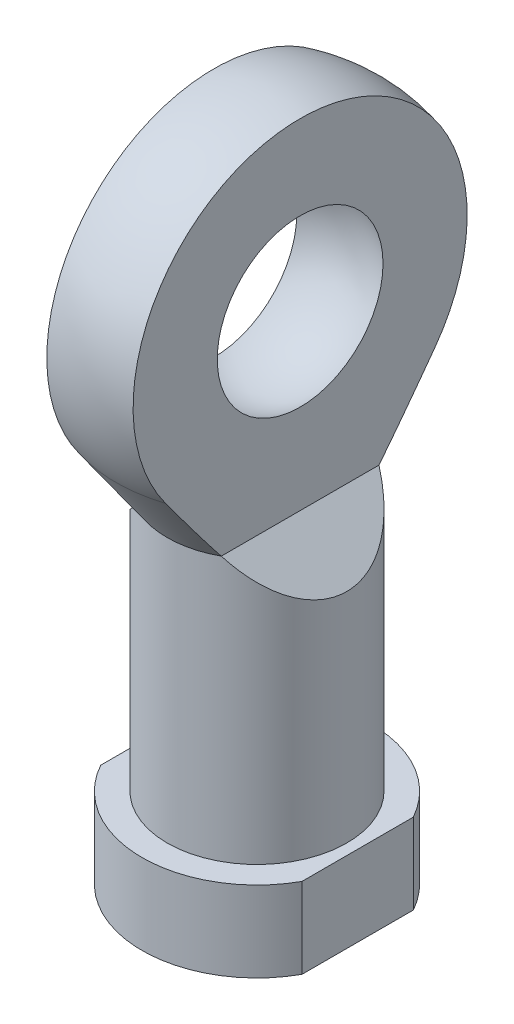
ISO-10303-21;
HEADER;
FILE_DESCRIPTION(('STEP AP214'),'2;1');
FILE_NAME('part.step','',(''),(''),'','','');
FILE_SCHEMA(('AUTOMOTIVE_DESIGN { 1 0 10303 214 1 1 1 1 }'));
ENDSEC;
DATA;
#1=APPLICATION_CONTEXT('core data for automotive mechanical design processes');
#2=APPLICATION_PROTOCOL_DEFINITION('international standard','automotive_design',2000,#1);
#3=PRODUCT_CONTEXT('',#1,'mechanical');
#4=PRODUCT('Part','Part','',(#3));
#5=PRODUCT_RELATED_PRODUCT_CATEGORY('part','',(#4));
#6=PRODUCT_DEFINITION_FORMATION('','',#4);
#7=PRODUCT_DEFINITION_CONTEXT('part definition',#1,'design');
#8=PRODUCT_DEFINITION('design','',#6,#7);
#9=PRODUCT_DEFINITION_SHAPE('','',#8);
#10=(LENGTH_UNIT() NAMED_UNIT(*) SI_UNIT(.MILLI.,.METRE.));
#11=(NAMED_UNIT(*) PLANE_ANGLE_UNIT() SI_UNIT($,.RADIAN.));
#12=(NAMED_UNIT(*) SI_UNIT($,.STERADIAN.) SOLID_ANGLE_UNIT());
#13=UNCERTAINTY_MEASURE_WITH_UNIT(LENGTH_MEASURE(1.E-05),#10,'distance_accuracy_value','');
#14=(GEOMETRIC_REPRESENTATION_CONTEXT(3) GLOBAL_UNCERTAINTY_ASSIGNED_CONTEXT((#13)) GLOBAL_UNIT_ASSIGNED_CONTEXT((#10,
#11,#12)) REPRESENTATION_CONTEXT('',''));
#15=CARTESIAN_POINT('',(0.,0.,0.));
#16=DIRECTION('',(0.,0.,1.));
#17=DIRECTION('',(1.,0.,0.));
#18=AXIS2_PLACEMENT_3D('',#15,#16,#17);
#19=CARTESIAN_POINT('',(0.,-15.9999999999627,0.));
#20=DIRECTION('',(0.,-1.,0.));
#21=DIRECTION('',(0.,0.,-1.));
#22=AXIS2_PLACEMENT_3D('',#19,#20,#21);
#23=CONICAL_SURFACE('',#22,2.99999999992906,1.04719755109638);
#24=CARTESIAN_POINT('',(-1.4210854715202E-10,-14.2679491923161,0.));
#25=VERTEX_POINT('',#24);
#26=VERTEX_LOOP('',#25);
#27=FACE_BOUND('',#26,.T.);
#28=CARTESIAN_POINT('',(0.,-16.,0.));
#29=DIRECTION('',(0.,1.,0.));
#30=DIRECTION('',(-1.,0.,0.));
#31=AXIS2_PLACEMENT_3D('',#28,#29,#30);
#32=CIRCLE('',#31,3.);
#33=CARTESIAN_POINT('',(-3.,-16.,0.));
#34=VERTEX_POINT('',#33);
#35=EDGE_CURVE('E88',#34,#34,#32,.F.);
#36=ORIENTED_EDGE('',*,*,#35,.T.);
#37=EDGE_LOOP('',(#36));
#38=FACE_BOUND('',#37,.T.);
#39=ADVANCED_FACE('F16',(#27,#38),#23,.F.);
#40=CARTESIAN_POINT('',(0.,-26.,0.));
#41=DIRECTION('',(0.,1.,0.));
#42=DIRECTION('',(-1.,0.,0.));
#43=AXIS2_PLACEMENT_3D('',#40,#41,#42);
#44=CYLINDRICAL_SURFACE('',#43,3.);
#45=CARTESIAN_POINT('',(0.,-36.,0.));
#46=DIRECTION('',(0.,1.,0.));
#47=DIRECTION('',(-1.,0.,0.));
#48=AXIS2_PLACEMENT_3D('',#45,#46,#47);
#49=CIRCLE('',#48,3.);
#50=CARTESIAN_POINT('',(-3.,-36.,0.));
#51=VERTEX_POINT('',#50);
#52=EDGE_CURVE('E19',#51,#51,#49,.T.);
#53=ORIENTED_EDGE('',*,*,#52,.F.);
#54=EDGE_LOOP('',(#53));
#55=FACE_BOUND('',#54,.T.);
#56=ORIENTED_EDGE('',*,*,#35,.F.);
#57=EDGE_LOOP('',(#56));
#58=FACE_BOUND('',#57,.T.);
#59=ADVANCED_FACE('F85',(#55,#58),#44,.F.);
#60=CARTESIAN_POINT('',(-4.,-36.,0.));
#61=DIRECTION('',(0.,-1.,0.));
#62=DIRECTION('',(0.,0.,-1.));
#63=AXIS2_PLACEMENT_3D('',#60,#61,#62);
#64=PLANE('',#63);
#65=DIRECTION('',(0.,0.,-1.));
#66=VECTOR('',#65,1.);
#67=CARTESIAN_POINT('',(-7.,-36.,-5.65685424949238));
#68=LINE('',#67,#66);
#69=CARTESIAN_POINT('',(-7.,-36.,3.87298334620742));
#70=VERTEX_POINT('',#69);
#71=CARTESIAN_POINT('',(-7.,-36.,-3.87298334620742));
#72=VERTEX_POINT('',#71);
#73=EDGE_CURVE('E241',#70,#72,#68,.T.);
#74=ORIENTED_EDGE('',*,*,#73,.T.);
#75=CARTESIAN_POINT('',(0.,-36.,0.));
#76=DIRECTION('',(0.,1.,0.));
#77=DIRECTION('',(0.,0.,1.));
#78=AXIS2_PLACEMENT_3D('',#75,#76,#77);
#79=CIRCLE('',#78,8.);
#80=CARTESIAN_POINT('',(7.,-36.,-3.87298334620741));
#81=VERTEX_POINT('',#80);
#82=EDGE_CURVE('E243',#81,#72,#79,.T.);
#83=ORIENTED_EDGE('',*,*,#82,.F.);
#84=DIRECTION('',(0.,0.,1.));
#85=VECTOR('',#84,1.);
#86=CARTESIAN_POINT('',(7.,-36.,5.65685424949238));
#87=LINE('',#86,#85);
#88=CARTESIAN_POINT('',(7.,-36.,3.87298334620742));
#89=VERTEX_POINT('',#88);
#90=EDGE_CURVE('E78',#81,#89,#87,.T.);
#91=ORIENTED_EDGE('',*,*,#90,.T.);
#92=CARTESIAN_POINT('',(0.,-36.,0.));
#93=DIRECTION('',(0.,1.,0.));
#94=DIRECTION('',(0.,0.,1.));
#95=AXIS2_PLACEMENT_3D('',#92,#93,#94);
#96=CIRCLE('',#95,8.);
#97=EDGE_CURVE('E232',#70,#89,#96,.T.);
#98=ORIENTED_EDGE('',*,*,#97,.F.);
#99=EDGE_LOOP('',(#74,#83,#91,#98));
#100=FACE_BOUND('',#99,.T.);
#101=ORIENTED_EDGE('',*,*,#52,.T.);
#102=EDGE_LOOP('',(#101));
#103=FACE_BOUND('',#102,.T.);
#104=ADVANCED_FACE('F160',(#100,#103),#64,.T.);
#105=CARTESIAN_POINT('',(7.,-36.,5.65685424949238));
#106=DIRECTION('',(-1.,0.,0.));
#107=DIRECTION('',(0.,0.,1.));
#108=AXIS2_PLACEMENT_3D('',#105,#106,#107);
#109=PLANE('',#108);
#110=DIRECTION('',(0.,0.,1.));
#111=VECTOR('',#110,1.);
#112=CARTESIAN_POINT('',(7.,-30.4,0.));
#113=LINE('',#112,#111);
#114=CARTESIAN_POINT('',(7.,-30.4,3.87298334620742));
#115=VERTEX_POINT('',#114);
#116=CARTESIAN_POINT('',(7.,-30.4,-3.87298334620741));
#117=VERTEX_POINT('',#116);
#118=EDGE_CURVE('E230',#115,#117,#113,.F.);
#119=ORIENTED_EDGE('',*,*,#118,.F.);
#120=DIRECTION('',(0.,1.,0.));
#121=VECTOR('',#120,1.);
#122=CARTESIAN_POINT('',(7.,-33.2,3.87298334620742));
#123=LINE('',#122,#121);
#124=EDGE_CURVE('E233',#89,#115,#123,.T.);
#125=ORIENTED_EDGE('',*,*,#124,.F.);
#126=ORIENTED_EDGE('',*,*,#90,.F.);
#127=DIRECTION('',(0.,1.,0.));
#128=VECTOR('',#127,1.);
#129=CARTESIAN_POINT('',(7.,-33.2,-3.87298334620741));
#130=LINE('',#129,#128);
#131=EDGE_CURVE('E242',#117,#81,#130,.F.);
#132=ORIENTED_EDGE('',*,*,#131,.F.);
#133=EDGE_LOOP('',(#119,#125,#126,#132));
#134=FACE_BOUND('',#133,.T.);
#135=ADVANCED_FACE('F156',(#134),#109,.F.);
#136=CARTESIAN_POINT('',(0.,-33.2,0.));
#137=DIRECTION('',(0.,1.,0.));
#138=DIRECTION('',(0.,0.,1.));
#139=AXIS2_PLACEMENT_3D('',#136,#137,#138);
#140=CYLINDRICAL_SURFACE('',#139,8.);
#141=DIRECTION('',(0.,1.,0.));
#142=VECTOR('',#141,1.);
#143=CARTESIAN_POINT('',(-7.,-36.,-3.87298334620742));
#144=LINE('',#143,#142);
#145=CARTESIAN_POINT('',(-7.,-30.4,-3.87298334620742));
#146=VERTEX_POINT('',#145);
#147=EDGE_CURVE('E236',#72,#146,#144,.T.);
#148=ORIENTED_EDGE('',*,*,#147,.T.);
#149=CARTESIAN_POINT('',(0.,-30.4,0.));
#150=DIRECTION('',(0.,1.,0.));
#151=DIRECTION('',(0.,0.,1.));
#152=AXIS2_PLACEMENT_3D('',#149,#150,#151);
#153=CIRCLE('',#152,8.);
#154=EDGE_CURVE('E229',#117,#146,#153,.T.);
#155=ORIENTED_EDGE('',*,*,#154,.F.);
#156=ORIENTED_EDGE('',*,*,#131,.T.);
#157=ORIENTED_EDGE('',*,*,#82,.T.);
#158=EDGE_LOOP('',(#148,#155,#156,#157));
#159=FACE_BOUND('',#158,.T.);
#160=ADVANCED_FACE('F152',(#159),#140,.T.);
#161=CARTESIAN_POINT('',(-7.,-36.,-5.65685424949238));
#162=DIRECTION('',(1.,0.,0.));
#163=DIRECTION('',(0.,0.,-1.));
#164=AXIS2_PLACEMENT_3D('',#161,#162,#163);
#165=PLANE('',#164);
#166=DIRECTION('',(0.,0.,1.));
#167=VECTOR('',#166,1.);
#168=CARTESIAN_POINT('',(-7.,-30.4,0.));
#169=LINE('',#168,#167);
#170=CARTESIAN_POINT('',(-7.,-30.4,3.87298334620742));
#171=VERTEX_POINT('',#170);
#172=EDGE_CURVE('E223',#146,#171,#169,.T.);
#173=ORIENTED_EDGE('',*,*,#172,.F.);
#174=ORIENTED_EDGE('',*,*,#147,.F.);
#175=ORIENTED_EDGE('',*,*,#73,.F.);
#176=DIRECTION('',(0.,1.,0.));
#177=VECTOR('',#176,1.);
#178=CARTESIAN_POINT('',(-7.,-33.2,3.87298334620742));
#179=LINE('',#178,#177);
#180=EDGE_CURVE('E235',#171,#70,#179,.F.);
#181=ORIENTED_EDGE('',*,*,#180,.F.);
#182=EDGE_LOOP('',(#173,#174,#175,#181));
#183=FACE_BOUND('',#182,.T.);
#184=ADVANCED_FACE('F148',(#183),#165,.F.);
#185=CARTESIAN_POINT('',(0.,-33.2,0.));
#186=DIRECTION('',(0.,1.,0.));
#187=DIRECTION('',(0.,0.,1.));
#188=AXIS2_PLACEMENT_3D('',#185,#186,#187);
#189=CYLINDRICAL_SURFACE('',#188,8.);
#190=ORIENTED_EDGE('',*,*,#180,.T.);
#191=ORIENTED_EDGE('',*,*,#97,.T.);
#192=ORIENTED_EDGE('',*,*,#124,.T.);
#193=CARTESIAN_POINT('',(0.,-30.4,0.));
#194=DIRECTION('',(0.,1.,0.));
#195=DIRECTION('',(0.,0.,1.));
#196=AXIS2_PLACEMENT_3D('',#193,#194,#195);
#197=CIRCLE('',#196,8.);
#198=EDGE_CURVE('E220',#171,#115,#197,.T.);
#199=ORIENTED_EDGE('',*,*,#198,.F.);
#200=EDGE_LOOP('',(#190,#191,#192,#199));
#201=FACE_BOUND('',#200,.T.);
#202=ADVANCED_FACE('F144',(#201),#189,.T.);
#203=CARTESIAN_POINT('',(-6.25,-15.25,12.));
#204=DIRECTION('',(0.707106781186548,-0.707106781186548,0.));
#205=DIRECTION('',(0.707106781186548,0.707106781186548,0.));
#206=AXIS2_PLACEMENT_3D('',#203,#204,#205);
#207=PLANE('',#206);
#208=DIRECTION('',(0.,0.,-1.));
#209=VECTOR('',#208,1.);
#210=CARTESIAN_POINT('',(-3.,-12.,12.));
#211=LINE('',#210,#209);
#212=CARTESIAN_POINT('',(-3.,-12.,5.48292804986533));
#213=VERTEX_POINT('',#212);
#214=CARTESIAN_POINT('',(-3.,-12.,-5.48292804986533));
#215=VERTEX_POINT('',#214);
#216=EDGE_CURVE('E218',#213,#215,#211,.T.);
#217=ORIENTED_EDGE('',*,*,#216,.T.);
#218=CARTESIAN_POINT('',(0.,-9.,0.));
#219=DIRECTION('',(0.707106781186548,-0.707106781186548,0.));
#220=DIRECTION('',(0.707106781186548,0.707106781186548,0.));
#221=AXIS2_PLACEMENT_3D('',#218,#219,#220);
#222=ELLIPSE('',#221,8.83883476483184,6.25);
#223=EDGE_CURVE('E121',#213,#215,#222,.T.);
#224=ORIENTED_EDGE('',*,*,#223,.F.);
#225=EDGE_LOOP('',(#217,#224));
#226=FACE_BOUND('',#225,.T.);
#227=ADVANCED_FACE('F140',(#226),#207,.F.);
#228=CARTESIAN_POINT('',(-7.125,-30.4,0.));
#229=DIRECTION('',(0.,1.,0.));
#230=DIRECTION('',(0.,0.,1.));
#231=AXIS2_PLACEMENT_3D('',#228,#229,#230);
#232=PLANE('',#231);
#233=CARTESIAN_POINT('',(0.,-30.4,0.));
#234=DIRECTION('',(0.,1.,0.));
#235=DIRECTION('',(0.,0.,1.));
#236=AXIS2_PLACEMENT_3D('',#233,#234,#235);
#237=CIRCLE('',#236,6.25);
#238=CARTESIAN_POINT('',(0.,-30.4,6.25));
#239=VERTEX_POINT('',#238);
#240=EDGE_CURVE('E203',#239,#239,#237,.T.);
#241=ORIENTED_EDGE('',*,*,#240,.F.);
#242=EDGE_LOOP('',(#241));
#243=FACE_BOUND('',#242,.T.);
#244=ORIENTED_EDGE('',*,*,#172,.T.);
#245=ORIENTED_EDGE('',*,*,#198,.T.);
#246=ORIENTED_EDGE('',*,*,#118,.T.);
#247=ORIENTED_EDGE('',*,*,#154,.T.);
#248=EDGE_LOOP('',(#244,#245,#246,#247));
#249=FACE_BOUND('',#248,.T.);
#250=ADVANCED_FACE('F134',(#243,#249),#232,.T.);
#251=CARTESIAN_POINT('',(-3.,-12.,12.));
#252=DIRECTION('',(1.,0.,0.));
#253=DIRECTION('',(0.,0.,-1.));
#254=AXIS2_PLACEMENT_3D('',#251,#252,#253);
#255=PLANE('',#254);
#256=CARTESIAN_POINT('',(-3.,-6.87879822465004,9.36387393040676));
#257=CARTESIAN_POINT('',(-3.,-7.09458332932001,9.20535377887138));
#258=CARTESIAN_POINT('',(-3.,-7.31019206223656,9.04659390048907));
#259=CARTESIAN_POINT('',(-3.,-7.74099139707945,8.72850716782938));
#260=CARTESIAN_POINT('',(-3.,-7.95618199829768,8.56918031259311));
#261=CARTESIAN_POINT('',(-3.,-8.60098912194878,8.09024725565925));
#262=CARTESIAN_POINT('',(-3.,-9.02987944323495,7.76966034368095));
#263=CARTESIAN_POINT('',(-3.,-9.67114204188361,7.28600459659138));
#264=CARTESIAN_POINT('',(-3.,-9.88455724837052,7.12431846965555));
#265=CARTESIAN_POINT('',(-3.,-10.3105317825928,6.79982477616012));
#266=CARTESIAN_POINT('',(-3.,-10.5230911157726,6.63701721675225));
#267=CARTESIAN_POINT('',(-3.,-10.947180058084,6.31002645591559));
#268=CARTESIAN_POINT('',(-3.,-11.1587095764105,6.14584313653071));
#269=CARTESIAN_POINT('',(-3.,-11.5804318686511,5.81575994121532));
#270=CARTESIAN_POINT('',(-3.,-11.7906246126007,5.64986002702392));
#271=CARTESIAN_POINT('',(-3.,-12.,5.48292804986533));
#272=B_SPLINE_CURVE_WITH_KNOTS('',3,(#256,#257,#258,#259,#260,#261,#262,#263,#264,#265,#266,
#267,#268,#269,#270,#271),.UNSPECIFIED.,.F.,.F.,(4,2,2,2,2,2,2,4),(0.,0.80325926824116,
1.60651989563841,3.21289800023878,4.0161361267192,4.81936913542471,5.62267173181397,
6.42599227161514),.UNSPECIFIED.);
#273=CARTESIAN_POINT('',(-3.,-6.87879822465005,9.36387393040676));
#274=VERTEX_POINT('',#273);
#275=EDGE_CURVE('E122',#274,#213,#272,.T.);
#276=ORIENTED_EDGE('',*,*,#275,.F.);
#277=CARTESIAN_POINT('',(-3.,0.,0.));
#278=DIRECTION('',(1.,0.,0.));
#279=DIRECTION('',(0.,0.,-1.));
#280=AXIS2_PLACEMENT_3D('',#277,#278,#279);
#281=CIRCLE('',#280,11.6189500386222);
#282=CARTESIAN_POINT('',(-3.,-6.87879822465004,-9.36387393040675));
#283=VERTEX_POINT('',#282);
#284=EDGE_CURVE('E193',#283,#274,#281,.T.);
#285=ORIENTED_EDGE('',*,*,#284,.F.);
#286=CARTESIAN_POINT('',(-3.,-12.,-5.48292804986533));
#287=CARTESIAN_POINT('',(-3.,-11.7906246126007,-5.64986002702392));
#288=CARTESIAN_POINT('',(-3.,-11.5804318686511,-5.81575994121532));
#289=CARTESIAN_POINT('',(-3.,-11.1587095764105,-6.14584313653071));
#290=CARTESIAN_POINT('',(-3.,-10.947180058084,-6.31002645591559));
#291=CARTESIAN_POINT('',(-3.,-10.5230911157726,-6.63701721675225));
#292=CARTESIAN_POINT('',(-3.,-10.3105317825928,-6.79982477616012));
#293=CARTESIAN_POINT('',(-3.,-9.88455724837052,-7.12431846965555));
#294=CARTESIAN_POINT('',(-3.,-9.67114204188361,-7.28600459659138));
#295=CARTESIAN_POINT('',(-3.,-9.02987944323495,-7.76966034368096));
#296=CARTESIAN_POINT('',(-3.,-8.60098912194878,-8.09024725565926));
#297=CARTESIAN_POINT('',(-3.,-7.95618199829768,-8.56918031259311));
#298=CARTESIAN_POINT('',(-3.,-7.74099139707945,-8.72850716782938));
#299=CARTESIAN_POINT('',(-3.,-7.31019206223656,-9.04659390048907));
#300=CARTESIAN_POINT('',(-3.,-7.09458332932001,-9.20535377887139));
#301=CARTESIAN_POINT('',(-3.,-6.87879822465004,-9.36387393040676));
#302=B_SPLINE_CURVE_WITH_KNOTS('',3,(#286,#287,#288,#289,#290,#291,#292,#293,#294,#295,#296,
#297,#298,#299,#300,#301),.UNSPECIFIED.,.F.,.F.,(4,2,2,2,2,2,2,4),(0.,0.803320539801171,
1.60662313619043,2.40985614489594,3.21309427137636,4.81947237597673,5.62273300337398,
6.42599227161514),.UNSPECIFIED.);
#303=EDGE_CURVE('E113',#215,#283,#302,.T.);
#304=ORIENTED_EDGE('',*,*,#303,.F.);
#305=ORIENTED_EDGE('',*,*,#216,.F.);
#306=EDGE_LOOP('',(#276,#285,#304,#305));
#307=FACE_BOUND('',#306,.T.);
#308=CARTESIAN_POINT('',(-3.,0.,0.));
#309=DIRECTION('',(1.,0.,0.));
#310=DIRECTION('',(0.,0.,-1.));
#311=AXIS2_PLACEMENT_3D('',#308,#309,#310);
#312=CIRCLE('',#311,5.7662812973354);
#313=CARTESIAN_POINT('',(-3.,0.,-5.7662812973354));
#314=VERTEX_POINT('',#313);
#315=EDGE_CURVE('E201',#314,#314,#312,.T.);
#316=ORIENTED_EDGE('',*,*,#315,.T.);
#317=EDGE_LOOP('',(#316));
#318=FACE_BOUND('',#317,.T.);
#319=ADVANCED_FACE('F128',(#307,#318),#255,.F.);
#320=CARTESIAN_POINT('',(0.,-21.2,0.));
#321=DIRECTION('',(0.,1.,0.));
#322=DIRECTION('',(0.,0.,1.));
#323=AXIS2_PLACEMENT_3D('',#320,#321,#322);
#324=CYLINDRICAL_SURFACE('',#323,6.25);
#325=CARTESIAN_POINT('',(0.,-12.,0.));
#326=DIRECTION('',(0.,1.,0.));
#327=DIRECTION('',(0.,0.,1.));
#328=AXIS2_PLACEMENT_3D('',#325,#326,#327);
#329=CIRCLE('',#328,6.25);
#330=CARTESIAN_POINT('',(3.,-12.,5.48292804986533));
#331=VERTEX_POINT('',#330);
#332=EDGE_CURVE('E198',#213,#331,#329,.T.);
#333=ORIENTED_EDGE('',*,*,#332,.F.);
#334=ORIENTED_EDGE('',*,*,#223,.T.);
#335=CARTESIAN_POINT('',(0.,-12.,0.));
#336=DIRECTION('',(0.,1.,0.));
#337=DIRECTION('',(0.,0.,1.));
#338=AXIS2_PLACEMENT_3D('',#335,#336,#337);
#339=CIRCLE('',#338,6.25);
#340=CARTESIAN_POINT('',(3.,-12.,-5.48292804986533));
#341=VERTEX_POINT('',#340);
#342=EDGE_CURVE('E181',#341,#215,#339,.T.);
#343=ORIENTED_EDGE('',*,*,#342,.F.);
#344=CARTESIAN_POINT('',(0.,-9.,0.));
#345=DIRECTION('',(-0.707106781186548,-0.707106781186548,0.));
#346=DIRECTION('',(-0.707106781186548,0.707106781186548,0.));
#347=AXIS2_PLACEMENT_3D('',#344,#345,#346);
#348=ELLIPSE('',#347,8.83883476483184,6.25);
#349=EDGE_CURVE('E199',#341,#331,#348,.T.);
#350=ORIENTED_EDGE('',*,*,#349,.T.);
#351=EDGE_LOOP('',(#333,#334,#343,#350));
#352=FACE_BOUND('',#351,.T.);
#353=ORIENTED_EDGE('',*,*,#240,.T.);
#354=EDGE_LOOP('',(#353));
#355=FACE_BOUND('',#354,.T.);
#356=ADVANCED_FACE('F133',(#352,#355),#324,.T.);
#357=CARTESIAN_POINT('',(0.,0.,0.));
#358=DIRECTION('',(1.,0.,0.));
#359=DIRECTION('',(0.,1.,0.));
#360=AXIS2_PLACEMENT_3D('',#357,#358,#359);
#361=SPHERICAL_SURFACE('',#360,6.5);
#362=CARTESIAN_POINT('',(3.,0.,0.));
#363=DIRECTION('',(1.,0.,0.));
#364=DIRECTION('',(0.,0.,-1.));
#365=AXIS2_PLACEMENT_3D('',#362,#363,#364);
#366=CIRCLE('',#365,5.7662812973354);
#367=CARTESIAN_POINT('',(3.,0.,-5.7662812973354));
#368=VERTEX_POINT('',#367);
#369=EDGE_CURVE('E178',#368,#368,#366,.T.);
#370=ORIENTED_EDGE('',*,*,#369,.T.);
#371=EDGE_LOOP('',(#370));
#372=FACE_BOUND('',#371,.T.);
#373=ORIENTED_EDGE('',*,*,#315,.F.);
#374=EDGE_LOOP('',(#373));
#375=FACE_BOUND('',#374,.T.);
#376=ADVANCED_FACE('F260',(#372,#375),#361,.F.);
#377=CARTESIAN_POINT('',(3.,-12.,12.));
#378=DIRECTION('',(-0.707106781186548,-0.707106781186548,0.));
#379=DIRECTION('',(0.707106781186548,-0.707106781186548,0.));
#380=AXIS2_PLACEMENT_3D('',#377,#378,#379);
#381=PLANE('',#380);
#382=DIRECTION('',(0.,0.,1.));
#383=VECTOR('',#382,1.);
#384=CARTESIAN_POINT('',(3.,-12.,12.));
#385=LINE('',#384,#383);
#386=EDGE_CURVE('E180',#341,#331,#385,.T.);
#387=ORIENTED_EDGE('',*,*,#386,.T.);
#388=ORIENTED_EDGE('',*,*,#349,.F.);
#389=EDGE_LOOP('',(#387,#388));
#390=FACE_BOUND('',#389,.T.);
#391=ADVANCED_FACE('F263',(#390),#381,.F.);
#392=CARTESIAN_POINT('',(0.,-6.87879822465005,0.));
#393=DIRECTION('',(0.,1.,0.));
#394=DIRECTION('',(0.,0.,1.));
#395=AXIS2_PLACEMENT_3D('',#392,#393,#394);
#396=CONICAL_SURFACE('',#395,9.8327074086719,0.610446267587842);
#397=CARTESIAN_POINT('',(3.,-12.,5.48292804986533));
#398=CARTESIAN_POINT('',(3.,-11.7906246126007,5.64986002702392));
#399=CARTESIAN_POINT('',(3.,-11.5804318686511,5.81575994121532));
#400=CARTESIAN_POINT('',(3.,-11.1587095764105,6.14584313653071));
#401=CARTESIAN_POINT('',(3.,-10.947180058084,6.31002645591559));
#402=CARTESIAN_POINT('',(3.,-10.5230911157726,6.63701721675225));
#403=CARTESIAN_POINT('',(3.,-10.3105317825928,6.79982477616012));
#404=CARTESIAN_POINT('',(3.,-9.88455724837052,7.12431846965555));
#405=CARTESIAN_POINT('',(3.,-9.67114204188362,7.28600459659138));
#406=CARTESIAN_POINT('',(3.,-9.02987944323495,7.76966034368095));
#407=CARTESIAN_POINT('',(3.,-8.60098912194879,8.09024725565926));
#408=CARTESIAN_POINT('',(3.,-7.95618199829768,8.56918031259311));
#409=CARTESIAN_POINT('',(3.,-7.74099139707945,8.72850716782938));
#410=CARTESIAN_POINT('',(3.,-7.31019206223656,9.04659390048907));
#411=CARTESIAN_POINT('',(3.,-7.09458332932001,9.20535377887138));
#412=CARTESIAN_POINT('',(3.,-6.87879822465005,9.36387393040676));
#413=B_SPLINE_CURVE_WITH_KNOTS('',3,(#397,#398,#399,#400,#401,#402,#403,#404,#405,#406,#407,
#408,#409,#410,#411,#412),.UNSPECIFIED.,.F.,.F.,(4,2,2,2,2,2,2,4),(0.,0.803320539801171,
1.60662313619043,2.40985614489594,3.21309427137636,4.81947237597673,5.62273300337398,
6.42599227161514),.UNSPECIFIED.);
#414=CARTESIAN_POINT('',(3.,-6.87879822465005,9.36387393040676));
#415=VERTEX_POINT('',#414);
#416=EDGE_CURVE('E184',#331,#415,#413,.T.);
#417=ORIENTED_EDGE('',*,*,#416,.T.);
#418=CARTESIAN_POINT('',(0.,-6.87879822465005,0.));
#419=DIRECTION('',(0.,1.,0.));
#420=DIRECTION('',(0.,0.,1.));
#421=AXIS2_PLACEMENT_3D('',#418,#419,#420);
#422=CIRCLE('',#421,9.8327074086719);
#423=EDGE_CURVE('E196',#274,#415,#422,.T.);
#424=ORIENTED_EDGE('',*,*,#423,.F.);
#425=ORIENTED_EDGE('',*,*,#275,.T.);
#426=ORIENTED_EDGE('',*,*,#332,.T.);
#427=EDGE_LOOP('',(#417,#424,#425,#426));
#428=FACE_BOUND('',#427,.T.);
#429=ADVANCED_FACE('F265',(#428),#396,.T.);
#430=CARTESIAN_POINT('',(0.,0.,0.));
#431=DIRECTION('',(1.,0.,0.));
#432=DIRECTION('',(0.,1.,0.));
#433=AXIS2_PLACEMENT_3D('',#430,#431,#432);
#434=SPHERICAL_SURFACE('',#433,12.);
#435=CARTESIAN_POINT('',(3.,0.,0.));
#436=DIRECTION('',(1.,0.,0.));
#437=DIRECTION('',(0.,0.,-1.));
#438=AXIS2_PLACEMENT_3D('',#435,#436,#437);
#439=CIRCLE('',#438,11.6189500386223);
#440=CARTESIAN_POINT('',(3.,-6.87879822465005,-9.36387393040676));
#441=VERTEX_POINT('',#440);
#442=EDGE_CURVE('E25',#415,#441,#439,.F.);
#443=ORIENTED_EDGE('',*,*,#442,.T.);
#444=CARTESIAN_POINT('',(0.,-6.87879822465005,0.));
#445=DIRECTION('',(0.,1.,0.));
#446=DIRECTION('',(0.,0.,1.));
#447=AXIS2_PLACEMENT_3D('',#444,#445,#446);
#448=CIRCLE('',#447,9.8327074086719);
#449=EDGE_CURVE('E186',#283,#441,#448,.F.);
#450=ORIENTED_EDGE('',*,*,#449,.F.);
#451=ORIENTED_EDGE('',*,*,#284,.T.);
#452=ORIENTED_EDGE('',*,*,#423,.T.);
#453=EDGE_LOOP('',(#443,#450,#451,#452));
#454=FACE_BOUND('',#453,.T.);
#455=ADVANCED_FACE('F107',(#454),#434,.T.);
#456=CARTESIAN_POINT('',(0.,-6.87879822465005,0.));
#457=DIRECTION('',(0.,1.,0.));
#458=DIRECTION('',(0.,0.,1.));
#459=AXIS2_PLACEMENT_3D('',#456,#457,#458);
#460=CONICAL_SURFACE('',#459,9.8327074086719,0.610446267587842);
#461=CARTESIAN_POINT('',(3.,-6.87879822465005,-9.36387393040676));
#462=CARTESIAN_POINT('',(3.,-7.09458332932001,-9.20535377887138));
#463=CARTESIAN_POINT('',(3.,-7.31019206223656,-9.04659390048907));
#464=CARTESIAN_POINT('',(3.,-7.74099139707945,-8.72850716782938));
#465=CARTESIAN_POINT('',(3.,-7.95618199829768,-8.56918031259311));
#466=CARTESIAN_POINT('',(3.,-8.60098912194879,-8.09024725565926));
#467=CARTESIAN_POINT('',(3.,-9.02987944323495,-7.76966034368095));
#468=CARTESIAN_POINT('',(3.,-9.67114204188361,-7.28600459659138));
#469=CARTESIAN_POINT('',(3.,-9.88455724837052,-7.12431846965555));
#470=CARTESIAN_POINT('',(3.,-10.3105317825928,-6.79982477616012));
#471=CARTESIAN_POINT('',(3.,-10.5230911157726,-6.63701721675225));
#472=CARTESIAN_POINT('',(3.,-10.947180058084,-6.31002645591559));
#473=CARTESIAN_POINT('',(3.,-11.1587095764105,-6.14584313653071));
#474=CARTESIAN_POINT('',(3.,-11.5804318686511,-5.81575994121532));
#475=CARTESIAN_POINT('',(3.,-11.7906246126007,-5.64986002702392));
#476=CARTESIAN_POINT('',(3.,-12.,-5.48292804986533));
#477=B_SPLINE_CURVE_WITH_KNOTS('',3,(#461,#462,#463,#464,#465,#466,#467,#468,#469,#470,#471,
#472,#473,#474,#475,#476),.UNSPECIFIED.,.F.,.F.,(4,2,2,2,2,2,2,4),(0.,0.803259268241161,
1.60651989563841,3.21289800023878,4.0161361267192,4.81936913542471,5.62267173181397,
6.42599227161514),.UNSPECIFIED.);
#478=EDGE_CURVE('E11',#441,#341,#477,.T.);
#479=ORIENTED_EDGE('',*,*,#478,.T.);
#480=ORIENTED_EDGE('',*,*,#342,.T.);
#481=ORIENTED_EDGE('',*,*,#303,.T.);
#482=ORIENTED_EDGE('',*,*,#449,.T.);
#483=EDGE_LOOP('',(#479,#480,#481,#482));
#484=FACE_BOUND('',#483,.T.);
#485=ADVANCED_FACE('F103',(#484),#460,.T.);
#486=CARTESIAN_POINT('',(3.,12.,12.));
#487=DIRECTION('',(-1.,0.,0.));
#488=DIRECTION('',(0.,0.,1.));
#489=AXIS2_PLACEMENT_3D('',#486,#487,#488);
#490=PLANE('',#489);
#491=ORIENTED_EDGE('',*,*,#478,.F.);
#492=ORIENTED_EDGE('',*,*,#442,.F.);
#493=ORIENTED_EDGE('',*,*,#416,.F.);
#494=ORIENTED_EDGE('',*,*,#386,.F.);
#495=EDGE_LOOP('',(#491,#492,#493,#494));
#496=FACE_BOUND('',#495,.T.);
#497=ORIENTED_EDGE('',*,*,#369,.F.);
#498=EDGE_LOOP('',(#497));
#499=FACE_BOUND('',#498,.T.);
#500=ADVANCED_FACE('F101',(#496,#499),#490,.F.);
#501=CLOSED_SHELL('',(#39,#59,#104,#135,#160,#184,#202,#227,#250,#319,#356,#376,#391,#429,#455,
#485,#500));
#502=MANIFOLD_SOLID_BREP('B1',#501);
#503=ADVANCED_BREP_SHAPE_REPRESENTATION('',(#18,#502),#14);
#504=SHAPE_DEFINITION_REPRESENTATION(#9,#503);
ENDSEC;
END-ISO-10303-21;
